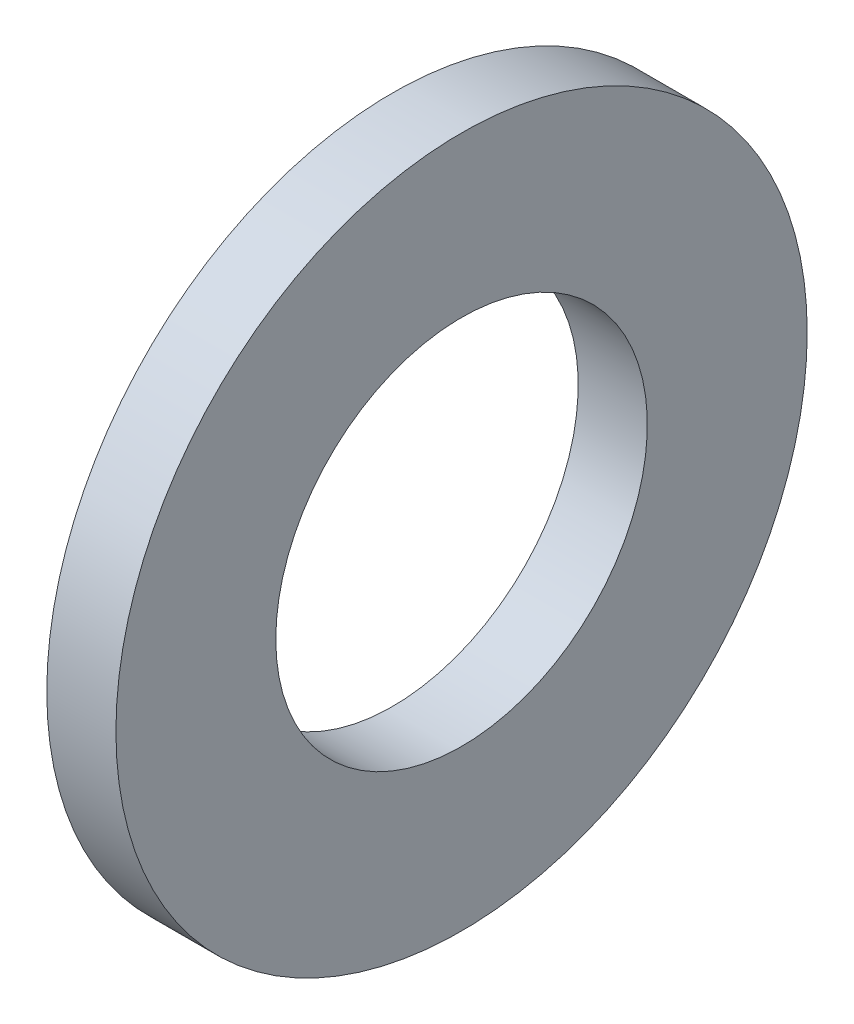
from build123d import *

# Parameters (mm, degrees)
ESQUISSE1_W = 0.8
ESQUISSE1_H = 1.85


with BuildPart() as part:
    # Esquisse1 → Base-R_volution (revolve)
    with BuildSketch(Plane(origin=(0, 0, 0), x_dir=(1, 0, 0), z_dir=(0, 1, 0)), mode=Mode.PRIVATE) as base_r_volution_sk:
        with Locations((0.4, 3.075)):
            Rectangle(ESQUISSE1_W, ESQUISSE1_H)
    revolve(base_r_volution_sk.sketch.rotate(Axis((0, 0, 0), (1, 0, 0)), 180), axis=Axis((0, 0, 0), (1, 0, 0)))


solid = part.part
